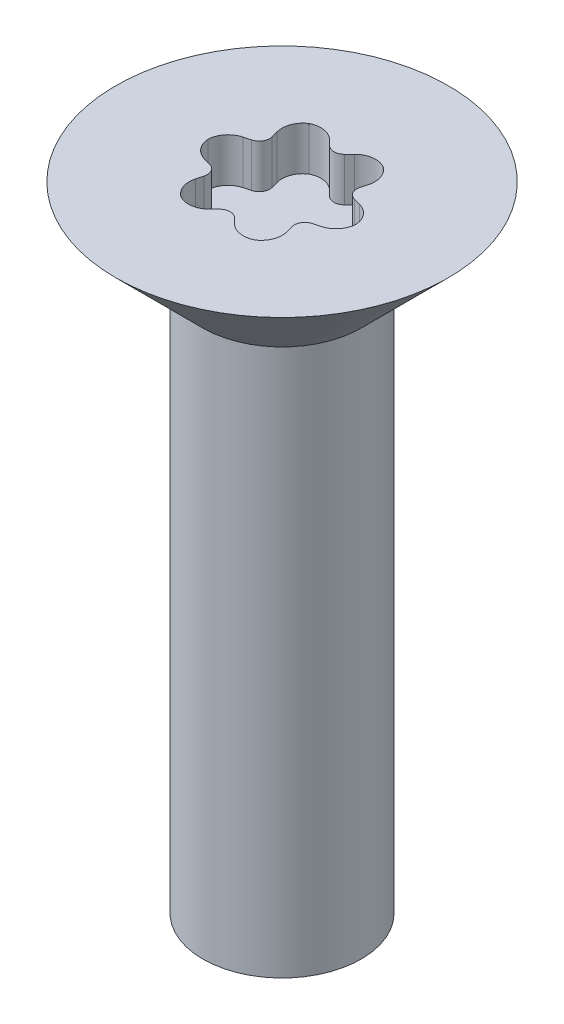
ISO-10303-21;
HEADER;
FILE_DESCRIPTION(('STEP AP214'),'2;1');
FILE_NAME('part.step','',(''),(''),'','','');
FILE_SCHEMA(('AUTOMOTIVE_DESIGN { 1 0 10303 214 1 1 1 1 }'));
ENDSEC;
DATA;
#1=APPLICATION_CONTEXT('core data for automotive mechanical design processes');
#2=APPLICATION_PROTOCOL_DEFINITION('international standard','automotive_design',2000,#1);
#3=PRODUCT_CONTEXT('',#1,'mechanical');
#4=PRODUCT('Part','Part','',(#3));
#5=PRODUCT_RELATED_PRODUCT_CATEGORY('part','',(#4));
#6=PRODUCT_DEFINITION_FORMATION('','',#4);
#7=PRODUCT_DEFINITION_CONTEXT('part definition',#1,'design');
#8=PRODUCT_DEFINITION('design','',#6,#7);
#9=PRODUCT_DEFINITION_SHAPE('','',#8);
#10=(LENGTH_UNIT() NAMED_UNIT(*) SI_UNIT(.MILLI.,.METRE.));
#11=(NAMED_UNIT(*) PLANE_ANGLE_UNIT() SI_UNIT($,.RADIAN.));
#12=(NAMED_UNIT(*) SI_UNIT($,.STERADIAN.) SOLID_ANGLE_UNIT());
#13=UNCERTAINTY_MEASURE_WITH_UNIT(LENGTH_MEASURE(1.E-05),#10,'distance_accuracy_value','');
#14=(GEOMETRIC_REPRESENTATION_CONTEXT(3) GLOBAL_UNCERTAINTY_ASSIGNED_CONTEXT((#13)) GLOBAL_UNIT_ASSIGNED_CONTEXT((#10,
#11,#12)) REPRESENTATION_CONTEXT('',''));
#15=CARTESIAN_POINT('',(0.,0.,0.));
#16=DIRECTION('',(0.,0.,1.));
#17=DIRECTION('',(1.,0.,0.));
#18=AXIS2_PLACEMENT_3D('',#15,#16,#17);
#19=CARTESIAN_POINT('',(0.,12.,0.));
#20=DIRECTION('',(0.,1.,0.));
#21=DIRECTION('',(0.,0.,1.));
#22=AXIS2_PLACEMENT_3D('',#19,#20,#21);
#23=PLANE('',#22);
#24=CARTESIAN_POINT('',(0.,12.,0.));
#25=DIRECTION('',(0.,1.,0.));
#26=DIRECTION('',(0.,0.,1.));
#27=AXIS2_PLACEMENT_3D('',#24,#25,#26);
#28=CIRCLE('',#27,3.14999999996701);
#29=CARTESIAN_POINT('',(0.,12.,3.14999999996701));
#30=VERTEX_POINT('',#29);
#31=EDGE_CURVE('E539',#30,#30,#28,.T.);
#32=ORIENTED_EDGE('',*,*,#31,.T.);
#33=EDGE_LOOP('',(#32));
#34=FACE_BOUND('',#33,.T.);
#35=DIRECTION('',(-0.965925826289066,0.,0.258819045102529));
#36=VECTOR('',#35,1.);
#37=CARTESIAN_POINT('',(0.164711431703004,12.,0.614711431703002));
#38=LINE('',#37,#36);
#39=CARTESIAN_POINT('',(1.10325980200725,12.,0.363228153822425));
#40=VERTEX_POINT('',#39);
#41=CARTESIAN_POINT('',(0.972608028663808,12.,0.398236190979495));
#42=VERTEX_POINT('',#41);
#43=EDGE_CURVE('E558',#40,#42,#38,.T.);
#44=ORIENTED_EDGE('',*,*,#43,.T.);
#45=CARTESIAN_POINT('',(1.02437183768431,12.,0.591421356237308));
#46=DIRECTION('',(0.,1.,0.));
#47=DIRECTION('',(0.,0.,1.));
#48=AXIS2_PLACEMENT_3D('',#45,#46,#47);
#49=CIRCLE('',#48,0.2);
#50=CARTESIAN_POINT('',(0.8311866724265,12.,0.643185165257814));
#51=VERTEX_POINT('',#50);
#52=EDGE_CURVE('E368',#42,#51,#49,.T.);
#53=ORIENTED_EDGE('',*,*,#52,.T.);
#54=DIRECTION('',(0.258819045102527,0.,0.965925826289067));
#55=VECTOR('',#54,1.);
#56=CARTESIAN_POINT('',(0.614711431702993,12.,-0.164711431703));
#57=LINE('',#56,#55);
#58=CARTESIAN_POINT('',(0.866194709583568,12.,0.773836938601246));
#59=VERTEX_POINT('',#58);
#60=EDGE_CURVE('E556',#51,#59,#57,.T.);
#61=ORIENTED_EDGE('',*,*,#60,.T.);
#62=CARTESIAN_POINT('',(0.479824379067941,12.,0.877364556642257));
#63=DIRECTION('',(0.,1.,0.));
#64=DIRECTION('',(0.,0.,1.));
#65=AXIS2_PLACEMENT_3D('',#62,#63,#64);
#66=CIRCLE('',#65,0.4);
#67=CARTESIAN_POINT('',(0.699531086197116,12.,1.21162338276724));
#68=VERTEX_POINT('',#67);
#69=EDGE_CURVE('E324',#59,#68,#66,.F.);
#70=ORIENTED_EDGE('',*,*,#69,.T.);
#71=CARTESIAN_POINT('',(0.519907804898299,12.,0.854222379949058));
#72=DIRECTION('',(0.,1.,0.));
#73=DIRECTION('',(0.,0.,1.));
#74=AXIS2_PLACEMENT_3D('',#71,#72,#73);
#75=CIRCLE('',#74,0.4);
#76=CARTESIAN_POINT('',(0.237065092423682,12.,1.13706509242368));
#77=VERTEX_POINT('',#76);
#78=EDGE_CURVE('E326',#68,#77,#75,.F.);
#79=ORIENTED_EDGE('',*,*,#78,.T.);
#80=DIRECTION('',(-0.707106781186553,0.,-0.707106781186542));
#81=VECTOR('',#80,1.);
#82=CARTESIAN_POINT('',(-0.45,12.,0.450000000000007));
#83=LINE('',#82,#81);
#84=CARTESIAN_POINT('',(0.141421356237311,12.,1.04142135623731));
#85=VERTEX_POINT('',#84);
#86=EDGE_CURVE('E553',#77,#85,#83,.T.);
#87=ORIENTED_EDGE('',*,*,#86,.T.);
#88=CARTESIAN_POINT('',(0.,12.,1.18284271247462));
#89=DIRECTION('',(0.,1.,0.));
#90=DIRECTION('',(0.,0.,1.));
#91=AXIS2_PLACEMENT_3D('',#88,#89,#90);
#92=CIRCLE('',#91,0.2);
#93=CARTESIAN_POINT('',(-0.141421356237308,12.,1.04142135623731));
#94=VERTEX_POINT('',#93);
#95=EDGE_CURVE('E366',#85,#94,#92,.T.);
#96=ORIENTED_EDGE('',*,*,#95,.T.);
#97=DIRECTION('',(-0.707106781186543,0.,0.707106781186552));
#98=VECTOR('',#97,1.);
#99=CARTESIAN_POINT('',(0.45,12.,0.449999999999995));
#100=LINE('',#99,#98);
#101=CARTESIAN_POINT('',(-0.237065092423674,12.,1.13706509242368));
#102=VERTEX_POINT('',#101);
#103=EDGE_CURVE('E551',#94,#102,#100,.T.);
#104=ORIENTED_EDGE('',*,*,#103,.T.);
#105=CARTESIAN_POINT('',(-0.519907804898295,12.,0.85422237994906));
#106=DIRECTION('',(0.,1.,0.));
#107=DIRECTION('',(0.,0.,1.));
#108=AXIS2_PLACEMENT_3D('',#105,#106,#107);
#109=CIRCLE('',#108,0.4);
#110=CARTESIAN_POINT('',(-0.699531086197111,12.,1.21162338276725));
#111=VERTEX_POINT('',#110);
#112=EDGE_CURVE('E328',#102,#111,#109,.F.);
#113=ORIENTED_EDGE('',*,*,#112,.T.);
#114=CARTESIAN_POINT('',(-0.479824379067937,12.,0.87736455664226));
#115=DIRECTION('',(0.,1.,0.));
#116=DIRECTION('',(0.,0.,1.));
#117=AXIS2_PLACEMENT_3D('',#114,#115,#116);
#118=CIRCLE('',#117,0.4);
#119=CARTESIAN_POINT('',(-0.866194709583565,12.,0.773836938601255));
#120=VERTEX_POINT('',#119);
#121=EDGE_CURVE('E330',#111,#120,#118,.F.);
#122=ORIENTED_EDGE('',*,*,#121,.T.);
#123=DIRECTION('',(0.258819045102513,0.,-0.965925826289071));
#124=VECTOR('',#123,1.);
#125=CARTESIAN_POINT('',(-0.614711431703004,12.,-0.164711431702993));
#126=LINE('',#125,#124);
#127=CARTESIAN_POINT('',(-0.831186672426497,12.,0.643185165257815));
#128=VERTEX_POINT('',#127);
#129=EDGE_CURVE('E549',#120,#128,#126,.T.);
#130=ORIENTED_EDGE('',*,*,#129,.T.);
#131=CARTESIAN_POINT('',(-1.02437183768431,12.,0.591421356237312));
#132=DIRECTION('',(0.,1.,0.));
#133=DIRECTION('',(0.,0.,1.));
#134=AXIS2_PLACEMENT_3D('',#131,#132,#133);
#135=CIRCLE('',#134,0.2);
#136=CARTESIAN_POINT('',(-0.972608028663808,12.,0.398236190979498));
#137=VERTEX_POINT('',#136);
#138=EDGE_CURVE('E364',#128,#137,#135,.T.);
#139=ORIENTED_EDGE('',*,*,#138,.T.);
#140=DIRECTION('',(-0.96592582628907,0.,-0.258819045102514));
#141=VECTOR('',#140,1.);
#142=CARTESIAN_POINT('',(-0.164711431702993,12.,0.614711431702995));
#143=LINE('',#142,#141);
#144=CARTESIAN_POINT('',(-1.10325980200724,12.,0.363228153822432));
#145=VERTEX_POINT('',#144);
#146=EDGE_CURVE('E547',#137,#145,#143,.T.);
#147=ORIENTED_EDGE('',*,*,#146,.T.);
#148=CARTESIAN_POINT('',(-0.999732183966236,12.,-0.023142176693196));
#149=DIRECTION('',(0.,1.,0.));
#150=DIRECTION('',(0.,0.,1.));
#151=AXIS2_PLACEMENT_3D('',#148,#149,#150);
#152=CIRCLE('',#151,0.4);
#153=CARTESIAN_POINT('',(-1.39906217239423,12.,0.));
#154=VERTEX_POINT('',#153);
#155=EDGE_CURVE('E332',#145,#154,#152,.F.);
#156=ORIENTED_EDGE('',*,*,#155,.T.);
#157=CARTESIAN_POINT('',(-0.999732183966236,12.,0.0231421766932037));
#158=DIRECTION('',(0.,1.,0.));
#159=DIRECTION('',(0.,0.,1.));
#160=AXIS2_PLACEMENT_3D('',#157,#158,#159);
#161=CIRCLE('',#160,0.4);
#162=CARTESIAN_POINT('',(-1.10325980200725,12.,-0.363228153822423));
#163=VERTEX_POINT('',#162);
#164=EDGE_CURVE('E334',#154,#163,#161,.F.);
#165=ORIENTED_EDGE('',*,*,#164,.T.);
#166=DIRECTION('',(0.965925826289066,0.,-0.258819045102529));
#167=VECTOR('',#166,1.);
#168=CARTESIAN_POINT('',(-0.164711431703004,12.,-0.614711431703));
#169=LINE('',#168,#167);
#170=CARTESIAN_POINT('',(-0.972608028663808,12.,-0.398236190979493));
#171=VERTEX_POINT('',#170);
#172=EDGE_CURVE('E544',#163,#171,#169,.T.);
#173=ORIENTED_EDGE('',*,*,#172,.T.);
#174=CARTESIAN_POINT('',(-1.02437183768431,12.,-0.591421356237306));
#175=DIRECTION('',(0.,1.,0.));
#176=DIRECTION('',(0.,0.,1.));
#177=AXIS2_PLACEMENT_3D('',#174,#175,#176);
#178=CIRCLE('',#177,0.2);
#179=CARTESIAN_POINT('',(-0.8311866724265,12.,-0.643185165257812));
#180=VERTEX_POINT('',#179);
#181=EDGE_CURVE('E362',#171,#180,#178,.T.);
#182=ORIENTED_EDGE('',*,*,#181,.T.);
#183=DIRECTION('',(-0.258819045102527,0.,-0.965925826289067));
#184=VECTOR('',#183,1.);
#185=CARTESIAN_POINT('',(-0.614711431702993,12.,0.164711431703));
#186=LINE('',#185,#184);
#187=CARTESIAN_POINT('',(-0.866194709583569,12.,-0.773836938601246));
#188=VERTEX_POINT('',#187);
#189=EDGE_CURVE('E542',#180,#188,#186,.T.);
#190=ORIENTED_EDGE('',*,*,#189,.T.);
#191=CARTESIAN_POINT('',(-0.479824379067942,12.,-0.877364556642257));
#192=DIRECTION('',(0.,1.,0.));
#193=DIRECTION('',(0.,0.,1.));
#194=AXIS2_PLACEMENT_3D('',#191,#192,#193);
#195=CIRCLE('',#194,0.4);
#196=CARTESIAN_POINT('',(-0.699531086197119,12.,-1.21162338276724));
#197=VERTEX_POINT('',#196);
#198=EDGE_CURVE('E336',#188,#197,#195,.F.);
#199=ORIENTED_EDGE('',*,*,#198,.T.);
#200=CARTESIAN_POINT('',(-0.5199078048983,12.,-0.854222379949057));
#201=DIRECTION('',(0.,1.,0.));
#202=DIRECTION('',(0.,0.,1.));
#203=AXIS2_PLACEMENT_3D('',#200,#201,#202);
#204=CIRCLE('',#203,0.4);
#205=CARTESIAN_POINT('',(-0.237065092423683,12.,-1.13706509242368));
#206=VERTEX_POINT('',#205);
#207=EDGE_CURVE('E338',#197,#206,#204,.F.);
#208=ORIENTED_EDGE('',*,*,#207,.T.);
#209=DIRECTION('',(0.707106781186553,0.,0.707106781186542));
#210=VECTOR('',#209,1.);
#211=CARTESIAN_POINT('',(0.45,12.,-0.450000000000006));
#212=LINE('',#211,#210);
#213=CARTESIAN_POINT('',(-0.14142135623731,12.,-1.04142135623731));
#214=VERTEX_POINT('',#213);
#215=EDGE_CURVE('E240',#206,#214,#212,.T.);
#216=ORIENTED_EDGE('',*,*,#215,.T.);
#217=CARTESIAN_POINT('',(0.,12.,-1.18284271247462));
#218=DIRECTION('',(0.,1.,0.));
#219=DIRECTION('',(0.,0.,1.));
#220=AXIS2_PLACEMENT_3D('',#217,#218,#219);
#221=CIRCLE('',#220,0.2);
#222=CARTESIAN_POINT('',(0.141421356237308,12.,-1.04142135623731));
#223=VERTEX_POINT('',#222);
#224=EDGE_CURVE('E236',#214,#223,#221,.T.);
#225=ORIENTED_EDGE('',*,*,#224,.T.);
#226=DIRECTION('',(0.707106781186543,0.,-0.707106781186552));
#227=VECTOR('',#226,1.);
#228=CARTESIAN_POINT('',(-0.45,12.,-0.449999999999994));
#229=LINE('',#228,#227);
#230=CARTESIAN_POINT('',(0.237065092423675,12.,-1.13706509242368));
#231=VERTEX_POINT('',#230);
#232=EDGE_CURVE('E230',#223,#231,#229,.T.);
#233=ORIENTED_EDGE('',*,*,#232,.T.);
#234=CARTESIAN_POINT('',(0.519907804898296,12.,-0.85422237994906));
#235=DIRECTION('',(0.,1.,0.));
#236=DIRECTION('',(0.,0.,1.));
#237=AXIS2_PLACEMENT_3D('',#234,#235,#236);
#238=CIRCLE('',#237,0.4);
#239=CARTESIAN_POINT('',(0.699531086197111,12.,-1.21162338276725));
#240=VERTEX_POINT('',#239);
#241=EDGE_CURVE('E233',#231,#240,#238,.F.);
#242=ORIENTED_EDGE('',*,*,#241,.T.);
#243=CARTESIAN_POINT('',(0.479824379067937,12.,-0.877364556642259));
#244=DIRECTION('',(0.,1.,0.));
#245=DIRECTION('',(0.,0.,1.));
#246=AXIS2_PLACEMENT_3D('',#243,#244,#245);
#247=CIRCLE('',#246,0.4);
#248=CARTESIAN_POINT('',(0.866194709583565,12.,-0.773836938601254));
#249=VERTEX_POINT('',#248);
#250=EDGE_CURVE('E250',#240,#249,#247,.F.);
#251=ORIENTED_EDGE('',*,*,#250,.T.);
#252=DIRECTION('',(-0.258819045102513,0.,0.96592582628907));
#253=VECTOR('',#252,1.);
#254=CARTESIAN_POINT('',(0.614711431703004,12.,0.164711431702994));
#255=LINE('',#254,#253);
#256=CARTESIAN_POINT('',(0.831186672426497,12.,-0.643185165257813));
#257=VERTEX_POINT('',#256);
#258=EDGE_CURVE('E562',#249,#257,#255,.T.);
#259=ORIENTED_EDGE('',*,*,#258,.T.);
#260=CARTESIAN_POINT('',(1.02437183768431,12.,-0.59142135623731));
#261=DIRECTION('',(0.,1.,0.));
#262=DIRECTION('',(0.,0.,1.));
#263=AXIS2_PLACEMENT_3D('',#260,#261,#262);
#264=CIRCLE('',#263,0.2);
#265=CARTESIAN_POINT('',(0.972608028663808,12.,-0.398236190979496));
#266=VERTEX_POINT('',#265);
#267=EDGE_CURVE('E359',#257,#266,#264,.T.);
#268=ORIENTED_EDGE('',*,*,#267,.T.);
#269=DIRECTION('',(0.96592582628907,0.,0.258819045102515));
#270=VECTOR('',#269,1.);
#271=CARTESIAN_POINT('',(0.164711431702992,12.,-0.614711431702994));
#272=LINE('',#271,#270);
#273=CARTESIAN_POINT('',(1.10325980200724,12.,-0.36322815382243));
#274=VERTEX_POINT('',#273);
#275=EDGE_CURVE('E560',#266,#274,#272,.T.);
#276=ORIENTED_EDGE('',*,*,#275,.T.);
#277=CARTESIAN_POINT('',(0.999732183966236,12.,0.0231421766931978));
#278=DIRECTION('',(0.,1.,0.));
#279=DIRECTION('',(0.,0.,1.));
#280=AXIS2_PLACEMENT_3D('',#277,#278,#279);
#281=CIRCLE('',#280,0.4);
#282=CARTESIAN_POINT('',(1.39906217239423,12.,0.));
#283=VERTEX_POINT('',#282);
#284=EDGE_CURVE('E320',#274,#283,#281,.F.);
#285=ORIENTED_EDGE('',*,*,#284,.T.);
#286=CARTESIAN_POINT('',(0.999732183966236,12.,-0.0231421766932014));
#287=DIRECTION('',(0.,1.,0.));
#288=DIRECTION('',(0.,0.,1.));
#289=AXIS2_PLACEMENT_3D('',#286,#287,#288);
#290=CIRCLE('',#289,0.4);
#291=EDGE_CURVE('E322',#283,#40,#290,.F.);
#292=ORIENTED_EDGE('',*,*,#291,.T.);
#293=EDGE_LOOP('',(#44,#53,#61,#70,#79,#87,#96,#104,#113,#122,#130,#139,#147,#156,#165,#173,
#182,#190,#199,#208,#216,#225,#233,#242,#251,#259,#268,#276,#285,#292));
#294=FACE_BOUND('',#293,.T.);
#295=ADVANCED_FACE('F34',(#34,#294),#23,.T.);
#296=CARTESIAN_POINT('',(0.,10.35,0.));
#297=DIRECTION('',(0.,-1.,0.));
#298=DIRECTION('',(0.,0.,-1.));
#299=AXIS2_PLACEMENT_3D('',#296,#297,#298);
#300=CYLINDRICAL_SURFACE('',#299,1.5);
#301=CARTESIAN_POINT('',(0.,10.35,0.));
#302=DIRECTION('',(0.,1.,0.));
#303=DIRECTION('',(0.,0.,1.));
#304=AXIS2_PLACEMENT_3D('',#301,#302,#303);
#305=CIRCLE('',#304,1.5);
#306=CARTESIAN_POINT('',(0.,10.35,1.5));
#307=VERTEX_POINT('',#306);
#308=EDGE_CURVE('E258',#307,#307,#305,.T.);
#309=ORIENTED_EDGE('',*,*,#308,.F.);
#310=EDGE_LOOP('',(#309));
#311=FACE_BOUND('',#310,.T.);
#312=CARTESIAN_POINT('',(0.,0.,0.));
#313=DIRECTION('',(0.,1.,0.));
#314=DIRECTION('',(0.,0.,1.));
#315=AXIS2_PLACEMENT_3D('',#312,#313,#314);
#316=CIRCLE('',#315,1.5);
#317=CARTESIAN_POINT('',(0.,0.,1.5));
#318=VERTEX_POINT('',#317);
#319=EDGE_CURVE('E263',#318,#318,#316,.T.);
#320=ORIENTED_EDGE('',*,*,#319,.T.);
#321=EDGE_LOOP('',(#320));
#322=FACE_BOUND('',#321,.T.);
#323=ADVANCED_FACE('F429',(#311,#322),#300,.T.);
#324=CARTESIAN_POINT('',(0.,0.,0.));
#325=DIRECTION('',(0.,1.,0.));
#326=DIRECTION('',(0.,0.,1.));
#327=AXIS2_PLACEMENT_3D('',#324,#325,#326);
#328=PLANE('',#327);
#329=ORIENTED_EDGE('',*,*,#319,.F.);
#330=EDGE_LOOP('',(#329));
#331=FACE_BOUND('',#330,.T.);
#332=ADVANCED_FACE('F435',(#331),#328,.F.);
#333=CARTESIAN_POINT('',(0.,10.35,0.));
#334=DIRECTION('',(0.,1.,0.));
#335=DIRECTION('',(0.,0.,1.));
#336=AXIS2_PLACEMENT_3D('',#333,#334,#335);
#337=CONICAL_SURFACE('',#336,1.5,0.785398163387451);
#338=ORIENTED_EDGE('',*,*,#31,.F.);
#339=EDGE_LOOP('',(#338));
#340=FACE_BOUND('',#339,.T.);
#341=ORIENTED_EDGE('',*,*,#308,.T.);
#342=EDGE_LOOP('',(#341));
#343=FACE_BOUND('',#342,.T.);
#344=ADVANCED_FACE('F442',(#340,#343),#337,.T.);
#345=CARTESIAN_POINT('',(-0.45,11.17,-0.449999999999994));
#346=DIRECTION('',(0.707106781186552,0.,0.707106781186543));
#347=DIRECTION('',(0.707106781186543,0.,-0.707106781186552));
#348=AXIS2_PLACEMENT_3D('',#345,#346,#347);
#349=PLANE('',#348);
#350=ORIENTED_EDGE('',*,*,#232,.F.);
#351=DIRECTION('',(0.,1.,0.));
#352=VECTOR('',#351,1.);
#353=CARTESIAN_POINT('',(0.141421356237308,11.17,-1.04142135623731));
#354=LINE('',#353,#352);
#355=CARTESIAN_POINT('',(0.141421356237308,11.17,-1.04142135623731));
#356=VERTEX_POINT('',#355);
#357=EDGE_CURVE('E390',#223,#356,#354,.F.);
#358=ORIENTED_EDGE('',*,*,#357,.T.);
#359=DIRECTION('',(0.707106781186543,0.,-0.707106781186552));
#360=VECTOR('',#359,1.);
#361=CARTESIAN_POINT('',(-0.45,11.17,-0.449999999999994));
#362=LINE('',#361,#360);
#363=CARTESIAN_POINT('',(0.237065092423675,11.17,-1.13706509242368));
#364=VERTEX_POINT('',#363);
#365=EDGE_CURVE('E255',#356,#364,#362,.T.);
#366=ORIENTED_EDGE('',*,*,#365,.T.);
#367=DIRECTION('',(0.,1.,0.));
#368=VECTOR('',#367,1.);
#369=CARTESIAN_POINT('',(0.237065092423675,11.17,-1.13706509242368));
#370=LINE('',#369,#368);
#371=EDGE_CURVE('E248',#364,#231,#370,.T.);
#372=ORIENTED_EDGE('',*,*,#371,.T.);
#373=EDGE_LOOP('',(#350,#358,#366,#372));
#374=FACE_BOUND('',#373,.T.);
#375=ADVANCED_FACE('F253',(#374),#349,.T.);
#376=CARTESIAN_POINT('',(0.614711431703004,11.17,0.164711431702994));
#377=DIRECTION('',(-0.96592582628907,0.,-0.258819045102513));
#378=DIRECTION('',(-0.258819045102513,0.,0.965925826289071));
#379=AXIS2_PLACEMENT_3D('',#376,#377,#378);
#380=PLANE('',#379);
#381=DIRECTION('',(-0.258819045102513,0.,0.96592582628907));
#382=VECTOR('',#381,1.);
#383=CARTESIAN_POINT('',(0.614711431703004,11.17,0.164711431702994));
#384=LINE('',#383,#382);
#385=CARTESIAN_POINT('',(0.866194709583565,11.17,-0.773836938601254));
#386=VERTEX_POINT('',#385);
#387=CARTESIAN_POINT('',(0.831186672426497,11.17,-0.643185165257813));
#388=VERTEX_POINT('',#387);
#389=EDGE_CURVE('E538',#386,#388,#384,.T.);
#390=ORIENTED_EDGE('',*,*,#389,.T.);
#391=DIRECTION('',(0.,1.,0.));
#392=VECTOR('',#391,1.);
#393=CARTESIAN_POINT('',(0.831186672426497,11.17,-0.643185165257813));
#394=LINE('',#393,#392);
#395=EDGE_CURVE('E392',#388,#257,#394,.T.);
#396=ORIENTED_EDGE('',*,*,#395,.T.);
#397=ORIENTED_EDGE('',*,*,#258,.F.);
#398=DIRECTION('',(0.,1.,0.));
#399=VECTOR('',#398,1.);
#400=CARTESIAN_POINT('',(0.866194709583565,11.17,-0.773836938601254));
#401=LINE('',#400,#399);
#402=EDGE_CURVE('E293',#249,#386,#401,.F.);
#403=ORIENTED_EDGE('',*,*,#402,.T.);
#404=EDGE_LOOP('',(#390,#396,#397,#403));
#405=FACE_BOUND('',#404,.T.);
#406=ADVANCED_FACE('F626',(#405),#380,.T.);
#407=CARTESIAN_POINT('',(0.164711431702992,11.17,-0.614711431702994));
#408=DIRECTION('',(-0.258819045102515,0.,0.96592582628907));
#409=DIRECTION('',(0.96592582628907,0.,0.258819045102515));
#410=AXIS2_PLACEMENT_3D('',#407,#408,#409);
#411=PLANE('',#410);
#412=ORIENTED_EDGE('',*,*,#275,.F.);
#413=DIRECTION('',(0.,1.,0.));
#414=VECTOR('',#413,1.);
#415=CARTESIAN_POINT('',(0.972608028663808,11.17,-0.398236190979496));
#416=LINE('',#415,#414);
#417=CARTESIAN_POINT('',(0.972608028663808,11.17,-0.398236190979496));
#418=VERTEX_POINT('',#417);
#419=EDGE_CURVE('E49',#266,#418,#416,.F.);
#420=ORIENTED_EDGE('',*,*,#419,.T.);
#421=DIRECTION('',(0.96592582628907,0.,0.258819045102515));
#422=VECTOR('',#421,1.);
#423=CARTESIAN_POINT('',(0.164711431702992,11.17,-0.614711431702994));
#424=LINE('',#423,#422);
#425=CARTESIAN_POINT('',(1.10325980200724,11.17,-0.36322815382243));
#426=VERTEX_POINT('',#425);
#427=EDGE_CURVE('E536',#418,#426,#424,.T.);
#428=ORIENTED_EDGE('',*,*,#427,.T.);
#429=DIRECTION('',(0.,1.,0.));
#430=VECTOR('',#429,1.);
#431=CARTESIAN_POINT('',(1.10325980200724,11.17,-0.36322815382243));
#432=LINE('',#431,#430);
#433=EDGE_CURVE('E295',#426,#274,#432,.T.);
#434=ORIENTED_EDGE('',*,*,#433,.T.);
#435=EDGE_LOOP('',(#412,#420,#428,#434));
#436=FACE_BOUND('',#435,.T.);
#437=ADVANCED_FACE('F622',(#436),#411,.T.);
#438=CARTESIAN_POINT('',(0.164711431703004,11.17,0.614711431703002));
#439=DIRECTION('',(-0.258819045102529,0.,-0.965925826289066));
#440=DIRECTION('',(-0.965925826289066,0.,0.258819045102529));
#441=AXIS2_PLACEMENT_3D('',#438,#439,#440);
#442=PLANE('',#441);
#443=DIRECTION('',(-0.965925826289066,0.,0.258819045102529));
#444=VECTOR('',#443,1.);
#445=CARTESIAN_POINT('',(0.164711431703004,11.17,0.614711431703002));
#446=LINE('',#445,#444);
#447=CARTESIAN_POINT('',(1.10325980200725,11.17,0.363228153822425));
#448=VERTEX_POINT('',#447);
#449=CARTESIAN_POINT('',(0.972608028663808,11.17,0.398236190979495));
#450=VERTEX_POINT('',#449);
#451=EDGE_CURVE('E533',#448,#450,#446,.T.);
#452=ORIENTED_EDGE('',*,*,#451,.T.);
#453=DIRECTION('',(0.,1.,0.));
#454=VECTOR('',#453,1.);
#455=CARTESIAN_POINT('',(0.972608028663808,11.17,0.398236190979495));
#456=LINE('',#455,#454);
#457=EDGE_CURVE('E340',#450,#42,#456,.T.);
#458=ORIENTED_EDGE('',*,*,#457,.T.);
#459=ORIENTED_EDGE('',*,*,#43,.F.);
#460=DIRECTION('',(0.,1.,0.));
#461=VECTOR('',#460,1.);
#462=CARTESIAN_POINT('',(1.10325980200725,11.17,0.363228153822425));
#463=LINE('',#462,#461);
#464=EDGE_CURVE('E298',#40,#448,#463,.F.);
#465=ORIENTED_EDGE('',*,*,#464,.T.);
#466=EDGE_LOOP('',(#452,#458,#459,#465));
#467=FACE_BOUND('',#466,.T.);
#468=ADVANCED_FACE('F618',(#467),#442,.T.);
#469=CARTESIAN_POINT('',(0.614711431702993,11.17,-0.164711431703));
#470=DIRECTION('',(-0.965925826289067,0.,0.258819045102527));
#471=DIRECTION('',(0.258819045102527,0.,0.965925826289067));
#472=AXIS2_PLACEMENT_3D('',#469,#470,#471);
#473=PLANE('',#472);
#474=ORIENTED_EDGE('',*,*,#60,.F.);
#475=DIRECTION('',(0.,1.,0.));
#476=VECTOR('',#475,1.);
#477=CARTESIAN_POINT('',(0.8311866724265,11.17,0.643185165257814));
#478=LINE('',#477,#476);
#479=CARTESIAN_POINT('',(0.8311866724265,11.17,0.643185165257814));
#480=VERTEX_POINT('',#479);
#481=EDGE_CURVE('E370',#51,#480,#478,.F.);
#482=ORIENTED_EDGE('',*,*,#481,.T.);
#483=DIRECTION('',(0.258819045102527,0.,0.965925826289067));
#484=VECTOR('',#483,1.);
#485=CARTESIAN_POINT('',(0.614711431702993,11.17,-0.164711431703));
#486=LINE('',#485,#484);
#487=CARTESIAN_POINT('',(0.866194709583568,11.17,0.773836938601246));
#488=VERTEX_POINT('',#487);
#489=EDGE_CURVE('E531',#480,#488,#486,.T.);
#490=ORIENTED_EDGE('',*,*,#489,.T.);
#491=DIRECTION('',(0.,1.,0.));
#492=VECTOR('',#491,1.);
#493=CARTESIAN_POINT('',(0.866194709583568,11.17,0.773836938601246));
#494=LINE('',#493,#492);
#495=EDGE_CURVE('E300',#488,#59,#494,.T.);
#496=ORIENTED_EDGE('',*,*,#495,.T.);
#497=EDGE_LOOP('',(#474,#482,#490,#496));
#498=FACE_BOUND('',#497,.T.);
#499=ADVANCED_FACE('F614',(#498),#473,.T.);
#500=CARTESIAN_POINT('',(-0.45,11.17,0.450000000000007));
#501=DIRECTION('',(0.707106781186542,0.,-0.707106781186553));
#502=DIRECTION('',(-0.707106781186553,0.,-0.707106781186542));
#503=AXIS2_PLACEMENT_3D('',#500,#501,#502);
#504=PLANE('',#503);
#505=DIRECTION('',(-0.707106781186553,0.,-0.707106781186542));
#506=VECTOR('',#505,1.);
#507=CARTESIAN_POINT('',(-0.45,11.17,0.450000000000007));
#508=LINE('',#507,#506);
#509=CARTESIAN_POINT('',(0.237065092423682,11.17,1.13706509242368));
#510=VERTEX_POINT('',#509);
#511=CARTESIAN_POINT('',(0.141421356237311,11.17,1.04142135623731));
#512=VERTEX_POINT('',#511);
#513=EDGE_CURVE('E523',#510,#512,#508,.T.);
#514=ORIENTED_EDGE('',*,*,#513,.T.);
#515=DIRECTION('',(0.,1.,0.));
#516=VECTOR('',#515,1.);
#517=CARTESIAN_POINT('',(0.141421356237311,11.17,1.04142135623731));
#518=LINE('',#517,#516);
#519=EDGE_CURVE('E372',#512,#85,#518,.T.);
#520=ORIENTED_EDGE('',*,*,#519,.T.);
#521=ORIENTED_EDGE('',*,*,#86,.F.);
#522=DIRECTION('',(0.,1.,0.));
#523=VECTOR('',#522,1.);
#524=CARTESIAN_POINT('',(0.237065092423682,11.17,1.13706509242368));
#525=LINE('',#524,#523);
#526=EDGE_CURVE('E303',#77,#510,#525,.F.);
#527=ORIENTED_EDGE('',*,*,#526,.T.);
#528=EDGE_LOOP('',(#514,#520,#521,#527));
#529=FACE_BOUND('',#528,.T.);
#530=ADVANCED_FACE('F610',(#529),#504,.T.);
#531=CARTESIAN_POINT('',(0.45,11.17,0.449999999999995));
#532=DIRECTION('',(-0.707106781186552,0.,-0.707106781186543));
#533=DIRECTION('',(-0.707106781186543,0.,0.707106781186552));
#534=AXIS2_PLACEMENT_3D('',#531,#532,#533);
#535=PLANE('',#534);
#536=ORIENTED_EDGE('',*,*,#103,.F.);
#537=DIRECTION('',(0.,1.,0.));
#538=VECTOR('',#537,1.);
#539=CARTESIAN_POINT('',(-0.141421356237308,11.17,1.04142135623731));
#540=LINE('',#539,#538);
#541=CARTESIAN_POINT('',(-0.141421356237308,11.17,1.04142135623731));
#542=VERTEX_POINT('',#541);
#543=EDGE_CURVE('E375',#94,#542,#540,.F.);
#544=ORIENTED_EDGE('',*,*,#543,.T.);
#545=DIRECTION('',(-0.707106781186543,0.,0.707106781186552));
#546=VECTOR('',#545,1.);
#547=CARTESIAN_POINT('',(0.45,11.17,0.449999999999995));
#548=LINE('',#547,#546);
#549=CARTESIAN_POINT('',(-0.237065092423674,11.17,1.13706509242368));
#550=VERTEX_POINT('',#549);
#551=EDGE_CURVE('E521',#542,#550,#548,.T.);
#552=ORIENTED_EDGE('',*,*,#551,.T.);
#553=DIRECTION('',(0.,1.,0.));
#554=VECTOR('',#553,1.);
#555=CARTESIAN_POINT('',(-0.237065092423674,11.17,1.13706509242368));
#556=LINE('',#555,#554);
#557=EDGE_CURVE('E305',#550,#102,#556,.T.);
#558=ORIENTED_EDGE('',*,*,#557,.T.);
#559=EDGE_LOOP('',(#536,#544,#552,#558));
#560=FACE_BOUND('',#559,.T.);
#561=ADVANCED_FACE('F607',(#560),#535,.T.);
#562=CARTESIAN_POINT('',(-0.614711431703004,11.17,-0.164711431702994));
#563=DIRECTION('',(0.965925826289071,0.,0.258819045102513));
#564=DIRECTION('',(0.258819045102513,0.,-0.965925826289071));
#565=AXIS2_PLACEMENT_3D('',#562,#563,#564);
#566=PLANE('',#565);
#567=DIRECTION('',(0.258819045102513,0.,-0.965925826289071));
#568=VECTOR('',#567,1.);
#569=CARTESIAN_POINT('',(-0.614711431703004,11.17,-0.164711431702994));
#570=LINE('',#569,#568);
#571=CARTESIAN_POINT('',(-0.866194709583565,11.17,0.773836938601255));
#572=VERTEX_POINT('',#571);
#573=CARTESIAN_POINT('',(-0.831186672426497,11.17,0.643185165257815));
#574=VERTEX_POINT('',#573);
#575=EDGE_CURVE('E513',#572,#574,#570,.T.);
#576=ORIENTED_EDGE('',*,*,#575,.T.);
#577=DIRECTION('',(0.,1.,0.));
#578=VECTOR('',#577,1.);
#579=CARTESIAN_POINT('',(-0.831186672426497,11.17,0.643185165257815));
#580=LINE('',#579,#578);
#581=EDGE_CURVE('E377',#574,#128,#580,.T.);
#582=ORIENTED_EDGE('',*,*,#581,.T.);
#583=ORIENTED_EDGE('',*,*,#129,.F.);
#584=DIRECTION('',(0.,1.,0.));
#585=VECTOR('',#584,1.);
#586=CARTESIAN_POINT('',(-0.866194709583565,11.17,0.773836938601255));
#587=LINE('',#586,#585);
#588=EDGE_CURVE('E308',#120,#572,#587,.F.);
#589=ORIENTED_EDGE('',*,*,#588,.T.);
#590=EDGE_LOOP('',(#576,#582,#583,#589));
#591=FACE_BOUND('',#590,.T.);
#592=ADVANCED_FACE('F517',(#591),#566,.T.);
#593=CARTESIAN_POINT('',(-0.164711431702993,11.17,0.614711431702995));
#594=DIRECTION('',(0.258819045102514,0.,-0.96592582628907));
#595=DIRECTION('',(-0.96592582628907,0.,-0.258819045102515));
#596=AXIS2_PLACEMENT_3D('',#593,#594,#595);
#597=PLANE('',#596);
#598=ORIENTED_EDGE('',*,*,#146,.F.);
#599=DIRECTION('',(0.,1.,0.));
#600=VECTOR('',#599,1.);
#601=CARTESIAN_POINT('',(-0.972608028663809,11.17,0.398236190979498));
#602=LINE('',#601,#600);
#603=CARTESIAN_POINT('',(-0.972608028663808,11.17,0.398236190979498));
#604=VERTEX_POINT('',#603);
#605=EDGE_CURVE('E380',#137,#604,#602,.F.);
#606=ORIENTED_EDGE('',*,*,#605,.T.);
#607=DIRECTION('',(-0.96592582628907,0.,-0.258819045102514));
#608=VECTOR('',#607,1.);
#609=CARTESIAN_POINT('',(-0.164711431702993,11.17,0.614711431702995));
#610=LINE('',#609,#608);
#611=CARTESIAN_POINT('',(-1.10325980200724,11.17,0.363228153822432));
#612=VERTEX_POINT('',#611);
#613=EDGE_CURVE('E515',#604,#612,#610,.T.);
#614=ORIENTED_EDGE('',*,*,#613,.T.);
#615=DIRECTION('',(0.,1.,0.));
#616=VECTOR('',#615,1.);
#617=CARTESIAN_POINT('',(-1.10325980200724,11.17,0.363228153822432));
#618=LINE('',#617,#616);
#619=EDGE_CURVE('E310',#612,#145,#618,.T.);
#620=ORIENTED_EDGE('',*,*,#619,.T.);
#621=EDGE_LOOP('',(#598,#606,#614,#620));
#622=FACE_BOUND('',#621,.T.);
#623=ADVANCED_FACE('F599',(#622),#597,.T.);
#624=CARTESIAN_POINT('',(-0.164711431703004,11.17,-0.614711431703));
#625=DIRECTION('',(0.258819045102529,0.,0.965925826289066));
#626=DIRECTION('',(0.965925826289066,0.,-0.258819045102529));
#627=AXIS2_PLACEMENT_3D('',#624,#625,#626);
#628=PLANE('',#627);
#629=DIRECTION('',(0.965925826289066,0.,-0.258819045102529));
#630=VECTOR('',#629,1.);
#631=CARTESIAN_POINT('',(-0.164711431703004,11.17,-0.614711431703));
#632=LINE('',#631,#630);
#633=CARTESIAN_POINT('',(-1.10325980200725,11.17,-0.363228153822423));
#634=VERTEX_POINT('',#633);
#635=CARTESIAN_POINT('',(-0.972608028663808,11.17,-0.398236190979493));
#636=VERTEX_POINT('',#635);
#637=EDGE_CURVE('E525',#634,#636,#632,.T.);
#638=ORIENTED_EDGE('',*,*,#637,.T.);
#639=DIRECTION('',(0.,1.,0.));
#640=VECTOR('',#639,1.);
#641=CARTESIAN_POINT('',(-0.972608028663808,11.17,-0.398236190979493));
#642=LINE('',#641,#640);
#643=EDGE_CURVE('E382',#636,#171,#642,.T.);
#644=ORIENTED_EDGE('',*,*,#643,.T.);
#645=ORIENTED_EDGE('',*,*,#172,.F.);
#646=DIRECTION('',(0.,1.,0.));
#647=VECTOR('',#646,1.);
#648=CARTESIAN_POINT('',(-1.10325980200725,11.17,-0.363228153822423));
#649=LINE('',#648,#647);
#650=EDGE_CURVE('E313',#163,#634,#649,.F.);
#651=ORIENTED_EDGE('',*,*,#650,.T.);
#652=EDGE_LOOP('',(#638,#644,#645,#651));
#653=FACE_BOUND('',#652,.T.);
#654=ADVANCED_FACE('F578',(#653),#628,.T.);
#655=CARTESIAN_POINT('',(-0.614711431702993,11.17,0.164711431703));
#656=DIRECTION('',(0.965925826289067,0.,-0.258819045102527));
#657=DIRECTION('',(-0.258819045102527,0.,-0.965925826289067));
#658=AXIS2_PLACEMENT_3D('',#655,#656,#657);
#659=PLANE('',#658);
#660=ORIENTED_EDGE('',*,*,#189,.F.);
#661=DIRECTION('',(0.,1.,0.));
#662=VECTOR('',#661,1.);
#663=CARTESIAN_POINT('',(-0.8311866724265,11.17,-0.643185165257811));
#664=LINE('',#663,#662);
#665=CARTESIAN_POINT('',(-0.8311866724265,11.17,-0.643185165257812));
#666=VERTEX_POINT('',#665);
#667=EDGE_CURVE('E385',#180,#666,#664,.F.);
#668=ORIENTED_EDGE('',*,*,#667,.T.);
#669=DIRECTION('',(-0.258819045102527,0.,-0.965925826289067));
#670=VECTOR('',#669,1.);
#671=CARTESIAN_POINT('',(-0.614711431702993,11.17,0.164711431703));
#672=LINE('',#671,#670);
#673=CARTESIAN_POINT('',(-0.866194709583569,11.17,-0.773836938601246));
#674=VERTEX_POINT('',#673);
#675=EDGE_CURVE('E415',#666,#674,#672,.T.);
#676=ORIENTED_EDGE('',*,*,#675,.T.);
#677=DIRECTION('',(0.,1.,0.));
#678=VECTOR('',#677,1.);
#679=CARTESIAN_POINT('',(-0.866194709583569,11.17,-0.773836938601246));
#680=LINE('',#679,#678);
#681=EDGE_CURVE('E315',#674,#188,#680,.T.);
#682=ORIENTED_EDGE('',*,*,#681,.T.);
#683=EDGE_LOOP('',(#660,#668,#676,#682));
#684=FACE_BOUND('',#683,.T.);
#685=ADVANCED_FACE('F587',(#684),#659,.T.);
#686=CARTESIAN_POINT('',(0.45,11.17,-0.450000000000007));
#687=DIRECTION('',(-0.707106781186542,0.,0.707106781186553));
#688=DIRECTION('',(0.707106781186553,0.,0.707106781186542));
#689=AXIS2_PLACEMENT_3D('',#686,#687,#688);
#690=PLANE('',#689);
#691=DIRECTION('',(0.707106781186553,0.,0.707106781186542));
#692=VECTOR('',#691,1.);
#693=CARTESIAN_POINT('',(0.45,11.17,-0.450000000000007));
#694=LINE('',#693,#692);
#695=CARTESIAN_POINT('',(-0.237065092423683,11.17,-1.13706509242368));
#696=VERTEX_POINT('',#695);
#697=CARTESIAN_POINT('',(-0.14142135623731,11.17,-1.04142135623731));
#698=VERTEX_POINT('',#697);
#699=EDGE_CURVE('E407',#696,#698,#694,.T.);
#700=ORIENTED_EDGE('',*,*,#699,.T.);
#701=DIRECTION('',(0.,1.,0.));
#702=VECTOR('',#701,1.);
#703=CARTESIAN_POINT('',(-0.14142135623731,11.17,-1.04142135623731));
#704=LINE('',#703,#702);
#705=EDGE_CURVE('E387',#698,#214,#704,.T.);
#706=ORIENTED_EDGE('',*,*,#705,.T.);
#707=ORIENTED_EDGE('',*,*,#215,.F.);
#708=DIRECTION('',(0.,1.,0.));
#709=VECTOR('',#708,1.);
#710=CARTESIAN_POINT('',(-0.237065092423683,11.17,-1.13706509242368));
#711=LINE('',#710,#709);
#712=EDGE_CURVE('E251',#206,#696,#711,.F.);
#713=ORIENTED_EDGE('',*,*,#712,.T.);
#714=EDGE_LOOP('',(#700,#706,#707,#713));
#715=FACE_BOUND('',#714,.T.);
#716=ADVANCED_FACE('F412',(#715),#690,.T.);
#717=CARTESIAN_POINT('',(0.,11.17,0.));
#718=DIRECTION('',(0.,1.,0.));
#719=DIRECTION('',(0.,0.,1.));
#720=AXIS2_PLACEMENT_3D('',#717,#718,#719);
#721=PLANE('',#720);
#722=CARTESIAN_POINT('',(0.479824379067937,11.17,-0.877364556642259));
#723=DIRECTION('',(0.,1.,0.));
#724=DIRECTION('',(0.,0.,1.));
#725=AXIS2_PLACEMENT_3D('',#722,#723,#724);
#726=CIRCLE('',#725,0.4);
#727=CARTESIAN_POINT('',(0.699531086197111,11.17,-1.21162338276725));
#728=VERTEX_POINT('',#727);
#729=EDGE_CURVE('E289',#386,#728,#726,.T.);
#730=ORIENTED_EDGE('',*,*,#729,.T.);
#731=CARTESIAN_POINT('',(0.519907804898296,11.17,-0.85422237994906));
#732=DIRECTION('',(0.,1.,0.));
#733=DIRECTION('',(0.,0.,1.));
#734=AXIS2_PLACEMENT_3D('',#731,#732,#733);
#735=CIRCLE('',#734,0.4);
#736=EDGE_CURVE('E291',#728,#364,#735,.T.);
#737=ORIENTED_EDGE('',*,*,#736,.T.);
#738=ORIENTED_EDGE('',*,*,#365,.F.);
#739=CARTESIAN_POINT('',(0.,11.17,-1.18284271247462));
#740=DIRECTION('',(0.,1.,0.));
#741=DIRECTION('',(0.,0.,1.));
#742=AXIS2_PLACEMENT_3D('',#739,#740,#741);
#743=CIRCLE('',#742,0.2);
#744=EDGE_CURVE('E42',#356,#698,#743,.F.);
#745=ORIENTED_EDGE('',*,*,#744,.T.);
#746=ORIENTED_EDGE('',*,*,#699,.F.);
#747=CARTESIAN_POINT('',(-0.5199078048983,11.17,-0.854222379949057));
#748=DIRECTION('',(0.,1.,0.));
#749=DIRECTION('',(0.,0.,1.));
#750=AXIS2_PLACEMENT_3D('',#747,#748,#749);
#751=CIRCLE('',#750,0.4);
#752=CARTESIAN_POINT('',(-0.699531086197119,11.17,-1.21162338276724));
#753=VERTEX_POINT('',#752);
#754=EDGE_CURVE('E257',#696,#753,#751,.T.);
#755=ORIENTED_EDGE('',*,*,#754,.T.);
#756=CARTESIAN_POINT('',(-0.479824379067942,11.17,-0.877364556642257));
#757=DIRECTION('',(0.,1.,0.));
#758=DIRECTION('',(0.,0.,1.));
#759=AXIS2_PLACEMENT_3D('',#756,#757,#758);
#760=CIRCLE('',#759,0.4);
#761=EDGE_CURVE('E260',#753,#674,#760,.T.);
#762=ORIENTED_EDGE('',*,*,#761,.T.);
#763=ORIENTED_EDGE('',*,*,#675,.F.);
#764=CARTESIAN_POINT('',(-1.02437183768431,11.17,-0.591421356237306));
#765=DIRECTION('',(0.,1.,0.));
#766=DIRECTION('',(0.,0.,1.));
#767=AXIS2_PLACEMENT_3D('',#764,#765,#766);
#768=CIRCLE('',#767,0.2);
#769=EDGE_CURVE('E402',#666,#636,#768,.F.);
#770=ORIENTED_EDGE('',*,*,#769,.T.);
#771=ORIENTED_EDGE('',*,*,#637,.F.);
#772=CARTESIAN_POINT('',(-0.999732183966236,11.17,0.0231421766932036));
#773=DIRECTION('',(0.,1.,0.));
#774=DIRECTION('',(0.,0.,1.));
#775=AXIS2_PLACEMENT_3D('',#772,#773,#774);
#776=CIRCLE('',#775,0.4);
#777=CARTESIAN_POINT('',(-1.39906217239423,11.17,0.));
#778=VERTEX_POINT('',#777);
#779=EDGE_CURVE('E269',#634,#778,#776,.T.);
#780=ORIENTED_EDGE('',*,*,#779,.T.);
#781=CARTESIAN_POINT('',(-0.999732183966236,11.17,-0.023142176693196));
#782=DIRECTION('',(0.,1.,0.));
#783=DIRECTION('',(0.,0.,1.));
#784=AXIS2_PLACEMENT_3D('',#781,#782,#783);
#785=CIRCLE('',#784,0.4);
#786=EDGE_CURVE('E271',#778,#612,#785,.T.);
#787=ORIENTED_EDGE('',*,*,#786,.T.);
#788=ORIENTED_EDGE('',*,*,#613,.F.);
#789=CARTESIAN_POINT('',(-1.02437183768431,11.17,0.591421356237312));
#790=DIRECTION('',(0.,1.,0.));
#791=DIRECTION('',(0.,0.,1.));
#792=AXIS2_PLACEMENT_3D('',#789,#790,#791);
#793=CIRCLE('',#792,0.2);
#794=EDGE_CURVE('E400',#604,#574,#793,.F.);
#795=ORIENTED_EDGE('',*,*,#794,.T.);
#796=ORIENTED_EDGE('',*,*,#575,.F.);
#797=CARTESIAN_POINT('',(-0.479824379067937,11.17,0.87736455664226));
#798=DIRECTION('',(0.,1.,0.));
#799=DIRECTION('',(0.,0.,1.));
#800=AXIS2_PLACEMENT_3D('',#797,#798,#799);
#801=CIRCLE('',#800,0.4);
#802=CARTESIAN_POINT('',(-0.699531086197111,11.17,1.21162338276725));
#803=VERTEX_POINT('',#802);
#804=EDGE_CURVE('E274',#572,#803,#801,.T.);
#805=ORIENTED_EDGE('',*,*,#804,.T.);
#806=CARTESIAN_POINT('',(-0.519907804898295,11.17,0.85422237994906));
#807=DIRECTION('',(0.,1.,0.));
#808=DIRECTION('',(0.,0.,1.));
#809=AXIS2_PLACEMENT_3D('',#806,#807,#808);
#810=CIRCLE('',#809,0.4);
#811=EDGE_CURVE('E276',#803,#550,#810,.T.);
#812=ORIENTED_EDGE('',*,*,#811,.T.);
#813=ORIENTED_EDGE('',*,*,#551,.F.);
#814=CARTESIAN_POINT('',(0.,11.17,1.18284271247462));
#815=DIRECTION('',(0.,1.,0.));
#816=DIRECTION('',(0.,0.,1.));
#817=AXIS2_PLACEMENT_3D('',#814,#815,#816);
#818=CIRCLE('',#817,0.2);
#819=EDGE_CURVE('E398',#542,#512,#818,.F.);
#820=ORIENTED_EDGE('',*,*,#819,.T.);
#821=ORIENTED_EDGE('',*,*,#513,.F.);
#822=CARTESIAN_POINT('',(0.519907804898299,11.17,0.854222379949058));
#823=DIRECTION('',(0.,1.,0.));
#824=DIRECTION('',(0.,0.,1.));
#825=AXIS2_PLACEMENT_3D('',#822,#823,#824);
#826=CIRCLE('',#825,0.4);
#827=CARTESIAN_POINT('',(0.699531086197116,11.17,1.21162338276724));
#828=VERTEX_POINT('',#827);
#829=EDGE_CURVE('E279',#510,#828,#826,.T.);
#830=ORIENTED_EDGE('',*,*,#829,.T.);
#831=CARTESIAN_POINT('',(0.479824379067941,11.17,0.877364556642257));
#832=DIRECTION('',(0.,1.,0.));
#833=DIRECTION('',(0.,0.,1.));
#834=AXIS2_PLACEMENT_3D('',#831,#832,#833);
#835=CIRCLE('',#834,0.4);
#836=EDGE_CURVE('E281',#828,#488,#835,.T.);
#837=ORIENTED_EDGE('',*,*,#836,.T.);
#838=ORIENTED_EDGE('',*,*,#489,.F.);
#839=CARTESIAN_POINT('',(1.02437183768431,11.17,0.591421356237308));
#840=DIRECTION('',(0.,1.,0.));
#841=DIRECTION('',(0.,0.,1.));
#842=AXIS2_PLACEMENT_3D('',#839,#840,#841);
#843=CIRCLE('',#842,0.2);
#844=EDGE_CURVE('E396',#480,#450,#843,.F.);
#845=ORIENTED_EDGE('',*,*,#844,.T.);
#846=ORIENTED_EDGE('',*,*,#451,.F.);
#847=CARTESIAN_POINT('',(0.999732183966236,11.17,-0.0231421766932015));
#848=DIRECTION('',(0.,1.,0.));
#849=DIRECTION('',(0.,0.,1.));
#850=AXIS2_PLACEMENT_3D('',#847,#848,#849);
#851=CIRCLE('',#850,0.4);
#852=CARTESIAN_POINT('',(1.39906217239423,11.17,0.));
#853=VERTEX_POINT('',#852);
#854=EDGE_CURVE('E284',#448,#853,#851,.T.);
#855=ORIENTED_EDGE('',*,*,#854,.T.);
#856=CARTESIAN_POINT('',(0.999732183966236,11.17,0.0231421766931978));
#857=DIRECTION('',(0.,1.,0.));
#858=DIRECTION('',(0.,0.,1.));
#859=AXIS2_PLACEMENT_3D('',#856,#857,#858);
#860=CIRCLE('',#859,0.4);
#861=EDGE_CURVE('E286',#853,#426,#860,.T.);
#862=ORIENTED_EDGE('',*,*,#861,.T.);
#863=ORIENTED_EDGE('',*,*,#427,.F.);
#864=CARTESIAN_POINT('',(1.02437183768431,11.17,-0.59142135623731));
#865=DIRECTION('',(0.,1.,0.));
#866=DIRECTION('',(0.,0.,1.));
#867=AXIS2_PLACEMENT_3D('',#864,#865,#866);
#868=CIRCLE('',#867,0.2);
#869=EDGE_CURVE('E11',#418,#388,#868,.F.);
#870=ORIENTED_EDGE('',*,*,#869,.T.);
#871=ORIENTED_EDGE('',*,*,#389,.F.);
#872=EDGE_LOOP('',(#730,#737,#738,#745,#746,#755,#762,#763,#770,#771,#780,#787,#788,#795,#796,
#805,#812,#813,#820,#821,#830,#837,#838,#845,#846,#855,#862,#863,#870,#871));
#873=FACE_BOUND('',#872,.T.);
#874=ADVANCED_FACE('F406',(#873),#721,.T.);
#875=CARTESIAN_POINT('',(0.479824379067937,11.17,-0.877364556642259));
#876=DIRECTION('',(0.,1.,0.));
#877=DIRECTION('',(0.,0.,1.));
#878=AXIS2_PLACEMENT_3D('',#875,#876,#877);
#879=CYLINDRICAL_SURFACE('',#878,0.4);
#880=DIRECTION('',(0.,1.,0.));
#881=VECTOR('',#880,1.);
#882=CARTESIAN_POINT('',(0.699531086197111,11.585,-1.21162338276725));
#883=LINE('',#882,#881);
#884=EDGE_CURVE('E241',#728,#240,#883,.T.);
#885=ORIENTED_EDGE('',*,*,#884,.F.);
#886=ORIENTED_EDGE('',*,*,#729,.F.);
#887=ORIENTED_EDGE('',*,*,#402,.F.);
#888=ORIENTED_EDGE('',*,*,#250,.F.);
#889=EDGE_LOOP('',(#885,#886,#887,#888));
#890=FACE_BOUND('',#889,.T.);
#891=ADVANCED_FACE('F452',(#890),#879,.F.);
#892=CARTESIAN_POINT('',(0.519907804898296,11.17,-0.85422237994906));
#893=DIRECTION('',(0.,1.,0.));
#894=DIRECTION('',(0.,0.,1.));
#895=AXIS2_PLACEMENT_3D('',#892,#893,#894);
#896=CYLINDRICAL_SURFACE('',#895,0.4);
#897=ORIENTED_EDGE('',*,*,#736,.F.);
#898=ORIENTED_EDGE('',*,*,#884,.T.);
#899=ORIENTED_EDGE('',*,*,#241,.F.);
#900=ORIENTED_EDGE('',*,*,#371,.F.);
#901=EDGE_LOOP('',(#897,#898,#899,#900));
#902=FACE_BOUND('',#901,.T.);
#903=ADVANCED_FACE('F247',(#902),#896,.F.);
#904=CARTESIAN_POINT('',(0.999732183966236,11.17,-0.0231421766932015));
#905=DIRECTION('',(0.,1.,0.));
#906=DIRECTION('',(0.,0.,1.));
#907=AXIS2_PLACEMENT_3D('',#904,#905,#906);
#908=CYLINDRICAL_SURFACE('',#907,0.4);
#909=DIRECTION('',(0.,1.,0.));
#910=VECTOR('',#909,1.);
#911=CARTESIAN_POINT('',(1.39906217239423,11.585,0.));
#912=LINE('',#911,#910);
#913=EDGE_CURVE('E342',#853,#283,#912,.T.);
#914=ORIENTED_EDGE('',*,*,#913,.F.);
#915=ORIENTED_EDGE('',*,*,#854,.F.);
#916=ORIENTED_EDGE('',*,*,#464,.F.);
#917=ORIENTED_EDGE('',*,*,#291,.F.);
#918=EDGE_LOOP('',(#914,#915,#916,#917));
#919=FACE_BOUND('',#918,.T.);
#920=ADVANCED_FACE('F451',(#919),#908,.F.);
#921=CARTESIAN_POINT('',(0.999732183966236,11.17,0.0231421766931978));
#922=DIRECTION('',(0.,1.,0.));
#923=DIRECTION('',(0.,0.,1.));
#924=AXIS2_PLACEMENT_3D('',#921,#922,#923);
#925=CYLINDRICAL_SURFACE('',#924,0.4);
#926=ORIENTED_EDGE('',*,*,#861,.F.);
#927=ORIENTED_EDGE('',*,*,#913,.T.);
#928=ORIENTED_EDGE('',*,*,#284,.F.);
#929=ORIENTED_EDGE('',*,*,#433,.F.);
#930=EDGE_LOOP('',(#926,#927,#928,#929));
#931=FACE_BOUND('',#930,.T.);
#932=ADVANCED_FACE('F456',(#931),#925,.F.);
#933=CARTESIAN_POINT('',(0.519907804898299,11.17,0.854222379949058));
#934=DIRECTION('',(0.,1.,0.));
#935=DIRECTION('',(0.,0.,1.));
#936=AXIS2_PLACEMENT_3D('',#933,#934,#935);
#937=CYLINDRICAL_SURFACE('',#936,0.4);
#938=DIRECTION('',(0.,1.,0.));
#939=VECTOR('',#938,1.);
#940=CARTESIAN_POINT('',(0.699531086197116,11.585,1.21162338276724));
#941=LINE('',#940,#939);
#942=EDGE_CURVE('E345',#828,#68,#941,.T.);
#943=ORIENTED_EDGE('',*,*,#942,.F.);
#944=ORIENTED_EDGE('',*,*,#829,.F.);
#945=ORIENTED_EDGE('',*,*,#526,.F.);
#946=ORIENTED_EDGE('',*,*,#78,.F.);
#947=EDGE_LOOP('',(#943,#944,#945,#946));
#948=FACE_BOUND('',#947,.T.);
#949=ADVANCED_FACE('F459',(#948),#937,.F.);
#950=CARTESIAN_POINT('',(0.479824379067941,11.17,0.877364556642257));
#951=DIRECTION('',(0.,1.,0.));
#952=DIRECTION('',(0.,0.,1.));
#953=AXIS2_PLACEMENT_3D('',#950,#951,#952);
#954=CYLINDRICAL_SURFACE('',#953,0.4);
#955=ORIENTED_EDGE('',*,*,#836,.F.);
#956=ORIENTED_EDGE('',*,*,#942,.T.);
#957=ORIENTED_EDGE('',*,*,#69,.F.);
#958=ORIENTED_EDGE('',*,*,#495,.F.);
#959=EDGE_LOOP('',(#955,#956,#957,#958));
#960=FACE_BOUND('',#959,.T.);
#961=ADVANCED_FACE('F464',(#960),#954,.F.);
#962=CARTESIAN_POINT('',(-0.479824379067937,11.17,0.87736455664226));
#963=DIRECTION('',(0.,1.,0.));
#964=DIRECTION('',(0.,0.,1.));
#965=AXIS2_PLACEMENT_3D('',#962,#963,#964);
#966=CYLINDRICAL_SURFACE('',#965,0.4);
#967=DIRECTION('',(0.,1.,0.));
#968=VECTOR('',#967,1.);
#969=CARTESIAN_POINT('',(-0.699531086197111,11.585,1.21162338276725));
#970=LINE('',#969,#968);
#971=EDGE_CURVE('E348',#803,#111,#970,.T.);
#972=ORIENTED_EDGE('',*,*,#971,.F.);
#973=ORIENTED_EDGE('',*,*,#804,.F.);
#974=ORIENTED_EDGE('',*,*,#588,.F.);
#975=ORIENTED_EDGE('',*,*,#121,.F.);
#976=EDGE_LOOP('',(#972,#973,#974,#975));
#977=FACE_BOUND('',#976,.T.);
#978=ADVANCED_FACE('F467',(#977),#966,.F.);
#979=CARTESIAN_POINT('',(-0.519907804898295,11.17,0.85422237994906));
#980=DIRECTION('',(0.,1.,0.));
#981=DIRECTION('',(0.,0.,1.));
#982=AXIS2_PLACEMENT_3D('',#979,#980,#981);
#983=CYLINDRICAL_SURFACE('',#982,0.4);
#984=ORIENTED_EDGE('',*,*,#811,.F.);
#985=ORIENTED_EDGE('',*,*,#971,.T.);
#986=ORIENTED_EDGE('',*,*,#112,.F.);
#987=ORIENTED_EDGE('',*,*,#557,.F.);
#988=EDGE_LOOP('',(#984,#985,#986,#987));
#989=FACE_BOUND('',#988,.T.);
#990=ADVANCED_FACE('F472',(#989),#983,.F.);
#991=CARTESIAN_POINT('',(-0.999732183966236,11.17,0.0231421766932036));
#992=DIRECTION('',(0.,1.,0.));
#993=DIRECTION('',(0.,0.,1.));
#994=AXIS2_PLACEMENT_3D('',#991,#992,#993);
#995=CYLINDRICAL_SURFACE('',#994,0.4);
#996=DIRECTION('',(0.,1.,0.));
#997=VECTOR('',#996,1.);
#998=CARTESIAN_POINT('',(-1.39906217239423,11.585,0.));
#999=LINE('',#998,#997);
#1000=EDGE_CURVE('E351',#778,#154,#999,.T.);
#1001=ORIENTED_EDGE('',*,*,#1000,.F.);
#1002=ORIENTED_EDGE('',*,*,#779,.F.);
#1003=ORIENTED_EDGE('',*,*,#650,.F.);
#1004=ORIENTED_EDGE('',*,*,#164,.F.);
#1005=EDGE_LOOP('',(#1001,#1002,#1003,#1004));
#1006=FACE_BOUND('',#1005,.T.);
#1007=ADVANCED_FACE('F475',(#1006),#995,.F.);
#1008=CARTESIAN_POINT('',(-0.999732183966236,11.17,-0.023142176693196));
#1009=DIRECTION('',(0.,1.,0.));
#1010=DIRECTION('',(0.,0.,1.));
#1011=AXIS2_PLACEMENT_3D('',#1008,#1009,#1010);
#1012=CYLINDRICAL_SURFACE('',#1011,0.4);
#1013=ORIENTED_EDGE('',*,*,#786,.F.);
#1014=ORIENTED_EDGE('',*,*,#1000,.T.);
#1015=ORIENTED_EDGE('',*,*,#155,.F.);
#1016=ORIENTED_EDGE('',*,*,#619,.F.);
#1017=EDGE_LOOP('',(#1013,#1014,#1015,#1016));
#1018=FACE_BOUND('',#1017,.T.);
#1019=ADVANCED_FACE('F480',(#1018),#1012,.F.);
#1020=CARTESIAN_POINT('',(-0.5199078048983,11.17,-0.854222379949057));
#1021=DIRECTION('',(0.,1.,0.));
#1022=DIRECTION('',(0.,0.,1.));
#1023=AXIS2_PLACEMENT_3D('',#1020,#1021,#1022);
#1024=CYLINDRICAL_SURFACE('',#1023,0.4);
#1025=DIRECTION('',(0.,1.,0.));
#1026=VECTOR('',#1025,1.);
#1027=CARTESIAN_POINT('',(-0.699531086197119,11.585,-1.21162338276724));
#1028=LINE('',#1027,#1026);
#1029=EDGE_CURVE('E354',#753,#197,#1028,.T.);
#1030=ORIENTED_EDGE('',*,*,#1029,.F.);
#1031=ORIENTED_EDGE('',*,*,#754,.F.);
#1032=ORIENTED_EDGE('',*,*,#712,.F.);
#1033=ORIENTED_EDGE('',*,*,#207,.F.);
#1034=EDGE_LOOP('',(#1030,#1031,#1032,#1033));
#1035=FACE_BOUND('',#1034,.T.);
#1036=ADVANCED_FACE('F483',(#1035),#1024,.F.);
#1037=CARTESIAN_POINT('',(-0.479824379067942,11.17,-0.877364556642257));
#1038=DIRECTION('',(0.,1.,0.));
#1039=DIRECTION('',(0.,0.,1.));
#1040=AXIS2_PLACEMENT_3D('',#1037,#1038,#1039);
#1041=CYLINDRICAL_SURFACE('',#1040,0.4);
#1042=ORIENTED_EDGE('',*,*,#761,.F.);
#1043=ORIENTED_EDGE('',*,*,#1029,.T.);
#1044=ORIENTED_EDGE('',*,*,#198,.F.);
#1045=ORIENTED_EDGE('',*,*,#681,.F.);
#1046=EDGE_LOOP('',(#1042,#1043,#1044,#1045));
#1047=FACE_BOUND('',#1046,.T.);
#1048=ADVANCED_FACE('F488',(#1047),#1041,.F.);
#1049=CARTESIAN_POINT('',(1.02437183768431,11.17,0.591421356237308));
#1050=DIRECTION('',(0.,1.,0.));
#1051=DIRECTION('',(0.,0.,1.));
#1052=AXIS2_PLACEMENT_3D('',#1049,#1050,#1051);
#1053=CYLINDRICAL_SURFACE('',#1052,0.2);
#1054=ORIENTED_EDGE('',*,*,#844,.F.);
#1055=ORIENTED_EDGE('',*,*,#481,.F.);
#1056=ORIENTED_EDGE('',*,*,#52,.F.);
#1057=ORIENTED_EDGE('',*,*,#457,.F.);
#1058=EDGE_LOOP('',(#1054,#1055,#1056,#1057));
#1059=FACE_BOUND('',#1058,.T.);
#1060=ADVANCED_FACE('F491',(#1059),#1053,.T.);
#1061=CARTESIAN_POINT('',(0.,11.17,1.18284271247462));
#1062=DIRECTION('',(0.,1.,0.));
#1063=DIRECTION('',(0.,0.,1.));
#1064=AXIS2_PLACEMENT_3D('',#1061,#1062,#1063);
#1065=CYLINDRICAL_SURFACE('',#1064,0.2);
#1066=ORIENTED_EDGE('',*,*,#819,.F.);
#1067=ORIENTED_EDGE('',*,*,#543,.F.);
#1068=ORIENTED_EDGE('',*,*,#95,.F.);
#1069=ORIENTED_EDGE('',*,*,#519,.F.);
#1070=EDGE_LOOP('',(#1066,#1067,#1068,#1069));
#1071=FACE_BOUND('',#1070,.T.);
#1072=ADVANCED_FACE('F498',(#1071),#1065,.T.);
#1073=CARTESIAN_POINT('',(-1.02437183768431,11.17,0.591421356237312));
#1074=DIRECTION('',(0.,1.,0.));
#1075=DIRECTION('',(0.,0.,1.));
#1076=AXIS2_PLACEMENT_3D('',#1073,#1074,#1075);
#1077=CYLINDRICAL_SURFACE('',#1076,0.2);
#1078=ORIENTED_EDGE('',*,*,#794,.F.);
#1079=ORIENTED_EDGE('',*,*,#605,.F.);
#1080=ORIENTED_EDGE('',*,*,#138,.F.);
#1081=ORIENTED_EDGE('',*,*,#581,.F.);
#1082=EDGE_LOOP('',(#1078,#1079,#1080,#1081));
#1083=FACE_BOUND('',#1082,.T.);
#1084=ADVANCED_FACE('F425',(#1083),#1077,.T.);
#1085=CARTESIAN_POINT('',(-1.02437183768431,11.17,-0.591421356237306));
#1086=DIRECTION('',(0.,1.,0.));
#1087=DIRECTION('',(0.,0.,1.));
#1088=AXIS2_PLACEMENT_3D('',#1085,#1086,#1087);
#1089=CYLINDRICAL_SURFACE('',#1088,0.2);
#1090=ORIENTED_EDGE('',*,*,#769,.F.);
#1091=ORIENTED_EDGE('',*,*,#667,.F.);
#1092=ORIENTED_EDGE('',*,*,#181,.F.);
#1093=ORIENTED_EDGE('',*,*,#643,.F.);
#1094=EDGE_LOOP('',(#1090,#1091,#1092,#1093));
#1095=FACE_BOUND('',#1094,.T.);
#1096=ADVANCED_FACE('F419',(#1095),#1089,.T.);
#1097=CARTESIAN_POINT('',(0.,11.17,-1.18284271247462));
#1098=DIRECTION('',(0.,1.,0.));
#1099=DIRECTION('',(0.,0.,1.));
#1100=AXIS2_PLACEMENT_3D('',#1097,#1098,#1099);
#1101=CYLINDRICAL_SURFACE('',#1100,0.2);
#1102=ORIENTED_EDGE('',*,*,#744,.F.);
#1103=ORIENTED_EDGE('',*,*,#357,.F.);
#1104=ORIENTED_EDGE('',*,*,#224,.F.);
#1105=ORIENTED_EDGE('',*,*,#705,.F.);
#1106=EDGE_LOOP('',(#1102,#1103,#1104,#1105));
#1107=FACE_BOUND('',#1106,.T.);
#1108=ADVANCED_FACE('F417',(#1107),#1101,.T.);
#1109=CARTESIAN_POINT('',(1.02437183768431,11.17,-0.59142135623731));
#1110=DIRECTION('',(0.,1.,0.));
#1111=DIRECTION('',(0.,0.,1.));
#1112=AXIS2_PLACEMENT_3D('',#1109,#1110,#1111);
#1113=CYLINDRICAL_SURFACE('',#1112,0.2);
#1114=ORIENTED_EDGE('',*,*,#869,.F.);
#1115=ORIENTED_EDGE('',*,*,#419,.F.);
#1116=ORIENTED_EDGE('',*,*,#267,.F.);
#1117=ORIENTED_EDGE('',*,*,#395,.F.);
#1118=EDGE_LOOP('',(#1114,#1115,#1116,#1117));
#1119=FACE_BOUND('',#1118,.T.);
#1120=ADVANCED_FACE('F36',(#1119),#1113,.T.);
#1121=CLOSED_SHELL('',(#295,#323,#332,#344,#375,#406,#437,#468,#499,#530,#561,#592,#623,#654,
#685,#716,#874,#891,#903,#920,#932,#949,#961,#978,#990,#1007,#1019,#1036,#1048,#1060,#1072,
#1084,#1096,#1108,#1120));
#1122=MANIFOLD_SOLID_BREP('B2',#1121);
#1123=ADVANCED_BREP_SHAPE_REPRESENTATION('',(#18,#1122),#14);
#1124=SHAPE_DEFINITION_REPRESENTATION(#9,#1123);
ENDSEC;
END-ISO-10303-21;
